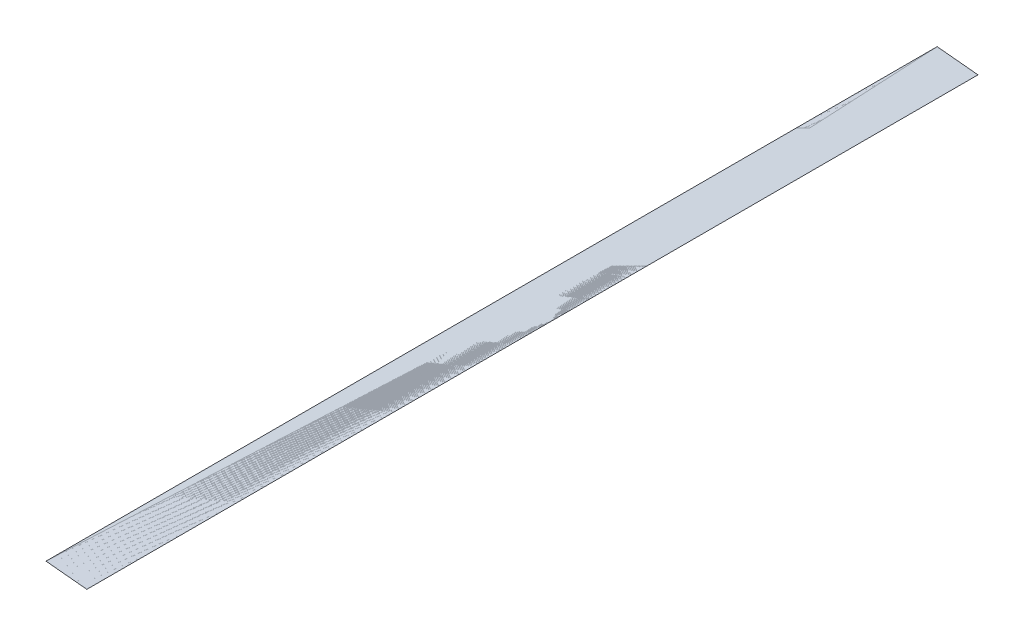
ISO-10303-21;
HEADER;
FILE_DESCRIPTION(('STEP AP214'),'2;1');
FILE_NAME('part.step','',(''),(''),'','','');
FILE_SCHEMA(('AUTOMOTIVE_DESIGN { 1 0 10303 214 1 1 1 1 }'));
ENDSEC;
DATA;
#1=APPLICATION_CONTEXT('core data for automotive mechanical design processes');
#2=APPLICATION_PROTOCOL_DEFINITION('international standard','automotive_design',2000,#1);
#3=PRODUCT_CONTEXT('',#1,'mechanical');
#4=PRODUCT('Part','Part','',(#3));
#5=PRODUCT_RELATED_PRODUCT_CATEGORY('part','',(#4));
#6=PRODUCT_DEFINITION_FORMATION('','',#4);
#7=PRODUCT_DEFINITION_CONTEXT('part definition',#1,'design');
#8=PRODUCT_DEFINITION('design','',#6,#7);
#9=PRODUCT_DEFINITION_SHAPE('','',#8);
#10=(LENGTH_UNIT() NAMED_UNIT(*) SI_UNIT(.MILLI.,.METRE.));
#11=(NAMED_UNIT(*) PLANE_ANGLE_UNIT() SI_UNIT($,.RADIAN.));
#12=(NAMED_UNIT(*) SI_UNIT($,.STERADIAN.) SOLID_ANGLE_UNIT());
#13=UNCERTAINTY_MEASURE_WITH_UNIT(LENGTH_MEASURE(1.E-05),#10,'distance_accuracy_value','');
#14=(GEOMETRIC_REPRESENTATION_CONTEXT(3) GLOBAL_UNCERTAINTY_ASSIGNED_CONTEXT((#13)) GLOBAL_UNIT_ASSIGNED_CONTEXT((#10,
#11,#12)) REPRESENTATION_CONTEXT('',''));
#15=CARTESIAN_POINT('',(0.,0.,0.));
#16=DIRECTION('',(0.,0.,1.));
#17=DIRECTION('',(1.,0.,0.));
#18=AXIS2_PLACEMENT_3D('',#15,#16,#17);
#19=CARTESIAN_POINT('',(287.207340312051,1142.35547189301,-920.981876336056));
#20=DIRECTION('',(1.4679475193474E-06,-0.999999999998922,2.65502653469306E-08));
#21=DIRECTION('',(0.999999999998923,1.46794751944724E-06,0.));
#22=AXIS2_PLACEMENT_3D('',#19,#20,#21);
#23=PLANE('',#22);
#24=CARTESIAN_POINT('',(234.132599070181,1142.35539464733,-895.925416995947));
#25=DIRECTION('',(-0.999999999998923,-1.46794587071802E-06,0.));
#26=VECTOR('',#25,1.);
#27=LINE('',#24,#26);
#28=CARTESIAN_POINT('',(234.132027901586,1142.34644712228,-895.925416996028));
#29=VERTEX_POINT('',#28);
#30=CARTESIAN_POINT('',(234.040358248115,1142.35539451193,-895.925416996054));
#31=VERTEX_POINT('',#30);
#32=EDGE_CURVE('E43',#29,#31,#27,.T.);
#33=ORIENTED_EDGE('',*,*,#32,.T.);
#34=DIRECTION('',(0.,0.,1.));
#35=VECTOR('',#34,1.);
#36=CARTESIAN_POINT('',(234.040358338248,1142.35539451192,-893.925416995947));
#37=LINE('',#36,#35);
#38=CARTESIAN_POINT('',(234.040358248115,1142.35539452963,-893.925416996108));
#39=VERTEX_POINT('',#38);
#40=EDGE_CURVE('E41',#31,#39,#37,.T.);
#41=ORIENTED_EDGE('',*,*,#40,.T.);
#42=CARTESIAN_POINT('',(234.040358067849,1142.35539456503,-893.925416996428));
#43=DIRECTION('',(0.999999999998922,1.46794827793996E-06,0.));
#44=VECTOR('',#43,1.);
#45=LINE('',#42,#44);
#46=CARTESIAN_POINT('',(234.132027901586,1142.34644714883,-893.925416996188));
#47=VERTEX_POINT('',#46);
#48=EDGE_CURVE('E28',#39,#47,#45,.T.);
#49=ORIENTED_EDGE('',*,*,#48,.T.);
#50=CARTESIAN_POINT('',(234.132599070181,1142.35539470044,-893.925416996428));
#51=DIRECTION('',(0.,-2.65503175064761E-08,-1.));
#52=VECTOR('',#51,1.);
#53=LINE('',#50,#52);
#54=EDGE_CURVE('E11',#47,#29,#53,.T.);
#55=ORIENTED_EDGE('',*,*,#54,.T.);
#56=EDGE_LOOP('',(#33,#41,#49,#55));
#57=FACE_BOUND('',#56,.T.);
#58=ADVANCED_FACE('F16',(#57),#23,.F.);
#59=CARTESIAN_POINT('',(234.132599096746,1142.33727519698,-893.925416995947));
#60=DIRECTION('',(0.192751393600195,0.981247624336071,0.));
#61=DIRECTION('',(-0.981247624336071,0.192751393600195,0.));
#62=AXIS2_PLACEMENT_3D('',#59,#60,#61);
#63=PLANE('',#62);
#64=ORIENTED_EDGE('',*,*,#48,.F.);
#65=ORIENTED_EDGE('',*,*,#40,.F.);
#66=ORIENTED_EDGE('',*,*,#32,.F.);
#67=ORIENTED_EDGE('',*,*,#54,.F.);
#68=EDGE_LOOP('',(#64,#65,#66,#67));
#69=FACE_BOUND('',#68,.T.);
#70=ADVANCED_FACE('F18',(#69),#63,.F.);
#71=CLOSED_SHELL('',(#58,#70));
#72=MANIFOLD_SOLID_BREP('B1',#71);
#73=ADVANCED_BREP_SHAPE_REPRESENTATION('',(#18,#72),#14);
#74=SHAPE_DEFINITION_REPRESENTATION(#9,#73);
ENDSEC;
END-ISO-10303-21;
